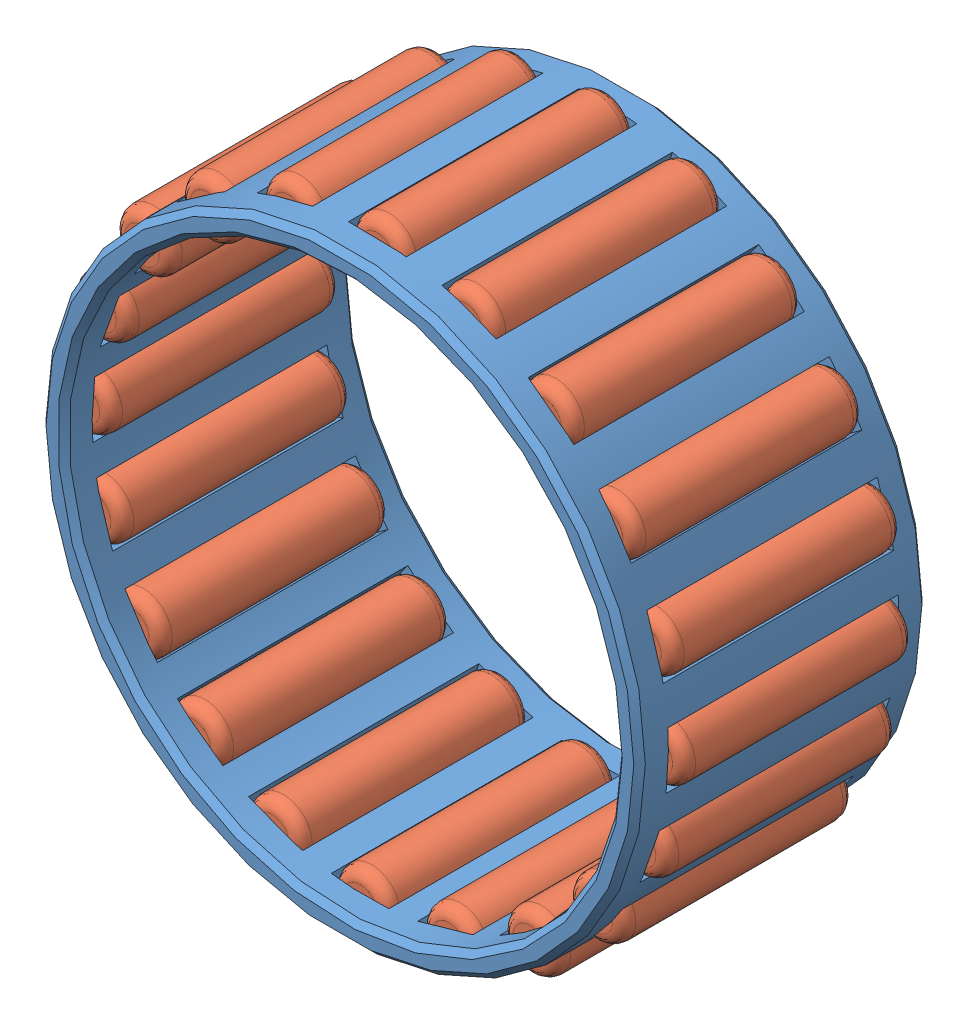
SolidWorks assembly cage aiguilles.SLDASM, configuration Défaut (file format 11000). Lengths in mm.
Overall size (56.42 56.42 25).
21 component instances, 2 part files, 3 mates.
Components (placement in the parent):
- cage-1: cage.SLDPRT [Défaut] at origin size (52 52 25)
- aiguille-1: aiguille.SLDPRT [Défaut] at (-0.75 -24.86 22.5) x (0.896338 -0.443372 0) z (0 0 -1) size (5 5 20)
- aiguille-2: aiguille.SLDPRT [Défaut] at (-8.3955 -23.4115 22.5) x (0.715458 -0.698655 0) z (0 0 -1) size (5 5 20)
- aiguille-3: aiguille.SLDPRT [Défaut] at (-15.2191 -19.6713 22.5) x (0.464545 -0.88555 0) z (0 0 -1) size (5 5 20)
- aiguille-4: aiguille.SLDPRT [Défaut] at (-20.553 -14.0056 22.5) x (0.168159 -0.98576 0) z (0 0 -1) size (5 5 20)
- aiguille-5: aiguille.SLDPRT [Défaut] at (-23.875 -6.9689 22.5) x (-0.144688 -0.989477 0) z (0 0 -1) size (5 5 20)
- aiguille-6: aiguille.SLDPRT [Défaut] at (-24.86 0.75 22.5) x (-0.443372 -0.896338 0) z (0 0 -1) size (5 5 20)
- aiguille-7: aiguille.SLDPRT [Défaut] at (-23.4115 8.3955 22.5) x (-0.698655 -0.715458 0) z (0 0 -1) size (5 5 20)
- aiguille-8: aiguille.SLDPRT [Défaut] at (-19.6713 15.2191 22.5) x (-0.88555 -0.464545 0) z (0 0 -1) size (5 5 20)
- aiguille-9: aiguille.SLDPRT [Défaut] at (-14.0056 20.553 22.5) x (-0.98576 -0.168159 0) z (0 0 -1) size (5 5 20)
- aiguille-10: aiguille.SLDPRT [Défaut] at (-6.9689 23.875 22.5) x (-0.989477 0.144688 0) z (0 0 -1) size (5 5 20)
- aiguille-11: aiguille.SLDPRT [Défaut] at (0.75 24.86 22.5) x (-0.896338 0.443372 0) z (0 0 -1) size (5 5 20)
- aiguille-12: aiguille.SLDPRT [Défaut] at (8.3955 23.4115 22.5) x (-0.715458 0.698655 0) z (0 0 -1) size (5 5 20)
- aiguille-13: aiguille.SLDPRT [Défaut] at (15.2191 19.6713 22.5) x (-0.464545 0.88555 0) z (0 0 -1) size (5 5 20)
- aiguille-14: aiguille.SLDPRT [Défaut] at (20.553 14.0056 22.5) x (-0.168159 0.98576 0) z (0 0 -1) size (5 5 20)
- aiguille-15: aiguille.SLDPRT [Défaut] at (23.875 6.9689 22.5) x (0.144688 0.989477 0) z (0 0 -1) size (5 5 20)
- aiguille-16: aiguille.SLDPRT [Défaut] at (24.86 -0.75 22.5) x (0.443372 0.896338 0) z (0 0 -1) size (5 5 20)
- aiguille-17: aiguille.SLDPRT [Défaut] at (23.4115 -8.3955 22.5) x (0.698655 0.715458 0) z (0 0 -1) size (5 5 20)
- aiguille-18: aiguille.SLDPRT [Défaut] at (19.6713 -15.2191 22.5) x (0.88555 0.464545 0) z (0 0 -1) size (5 5 20)
- aiguille-19: aiguille.SLDPRT [Défaut] at (14.0056 -20.553 22.5) x (0.98576 0.168159 0) z (0 0 -1) size (5 5 20)
- aiguille-20: aiguille.SLDPRT [Défaut] at (6.9689 -23.875 22.5) x (0.989477 -0.144688 0) z (0 0 -1) size (5 5 20)
Mates (geometry in assembly coordinates):
- Tangent1: tangent: plane of cage-1 through (-3.25 -26.001 2.5) normal (1 0 0); cylinder of aiguille-1 through (-0.75 -24.86 2.5) axis (0 0 1) radius 2.5
- Coïncidente1: coincident: plane of cage-1 through (-3.25 -26.001 2.5) normal (0 0 1); plane of aiguille-1 through (-0.75 -24.86 2.5) normal (0 0 -1)
- Coïncidente2: coincident: line of cage-1 through (47.643 -45.7862 22.5) axis (-0.917861 0.396903 0); point of aiguille-1
